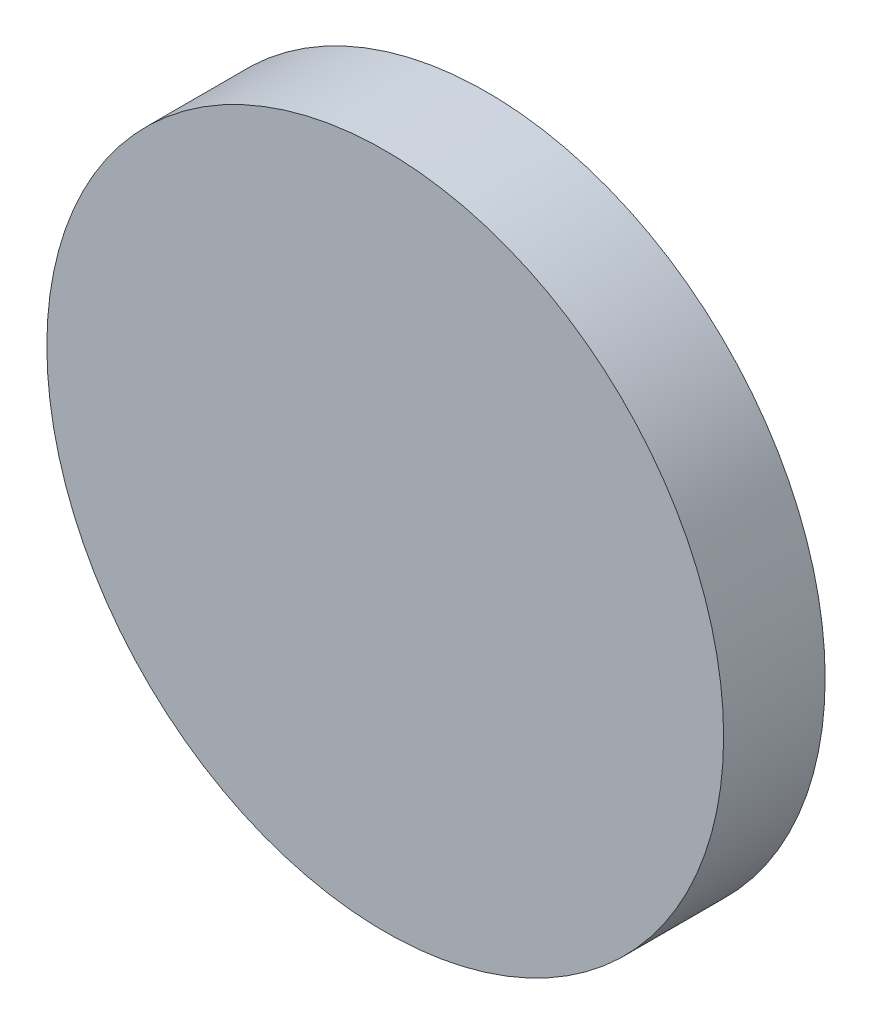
from build123d import *

# Parameters (mm, degrees)
SKETCH1_R           = 10
BOSS_EXTRUDE1_DEPTH = 3


with BuildPart() as part:
    # Sketch1 → Boss-Extrude1 (new body)
    with BuildSketch(Plane.XY):
        with Locations((-20, -24.747448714)):
            Circle(SKETCH1_R)
    extrude(amount=-BOSS_EXTRUDE1_DEPTH)


solid = part.part
